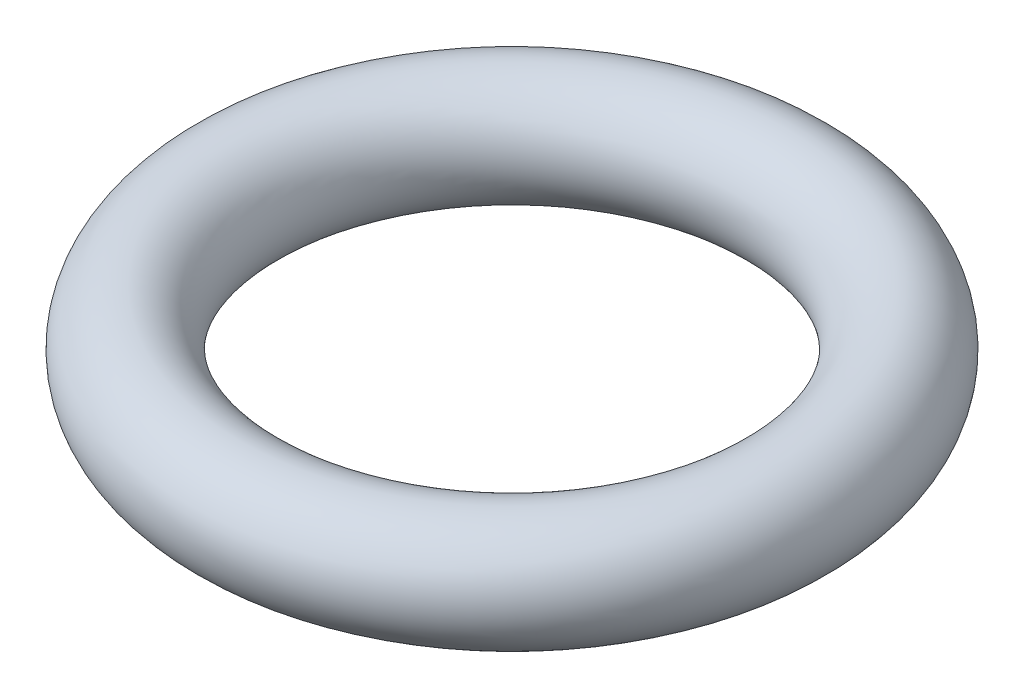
ISO-10303-21;
HEADER;
FILE_DESCRIPTION(('STEP AP214'),'2;1');
FILE_NAME('part.step','',(''),(''),'','','');
FILE_SCHEMA(('AUTOMOTIVE_DESIGN { 1 0 10303 214 1 1 1 1 }'));
ENDSEC;
DATA;
#1=APPLICATION_CONTEXT('core data for automotive mechanical design processes');
#2=APPLICATION_PROTOCOL_DEFINITION('international standard','automotive_design',2000,#1);
#3=PRODUCT_CONTEXT('',#1,'mechanical');
#4=PRODUCT('Part','Part','',(#3));
#5=PRODUCT_RELATED_PRODUCT_CATEGORY('part','',(#4));
#6=PRODUCT_DEFINITION_FORMATION('','',#4);
#7=PRODUCT_DEFINITION_CONTEXT('part definition',#1,'design');
#8=PRODUCT_DEFINITION('design','',#6,#7);
#9=PRODUCT_DEFINITION_SHAPE('','',#8);
#10=(LENGTH_UNIT() NAMED_UNIT(*) SI_UNIT(.MILLI.,.METRE.));
#11=(NAMED_UNIT(*) PLANE_ANGLE_UNIT() SI_UNIT($,.RADIAN.));
#12=(NAMED_UNIT(*) SI_UNIT($,.STERADIAN.) SOLID_ANGLE_UNIT());
#13=UNCERTAINTY_MEASURE_WITH_UNIT(LENGTH_MEASURE(1.E-05),#10,'distance_accuracy_value','');
#14=(GEOMETRIC_REPRESENTATION_CONTEXT(3) GLOBAL_UNCERTAINTY_ASSIGNED_CONTEXT((#13)) GLOBAL_UNIT_ASSIGNED_CONTEXT((#10,
#11,#12)) REPRESENTATION_CONTEXT('',''));
#15=CARTESIAN_POINT('',(0.,0.,0.));
#16=DIRECTION('',(0.,0.,1.));
#17=DIRECTION('',(1.,0.,0.));
#18=AXIS2_PLACEMENT_3D('',#15,#16,#17);
#19=CARTESIAN_POINT('',(0.,0.,0.));
#20=DIRECTION('',(0.,1.,0.));
#21=DIRECTION('',(0.,0.,1.));
#22=AXIS2_PLACEMENT_3D('',#19,#20,#21);
#23=TOROIDAL_SURFACE('',#22,4.15,0.85);
#24=CARTESIAN_POINT('',(0.,0.,5.));
#25=VERTEX_POINT('',#24);
#26=VERTEX_LOOP('',#25);
#27=FACE_BOUND('',#26,.T.);
#28=ADVANCED_FACE('F351',(#27),#23,.T.);
#29=CLOSED_SHELL('',(#28));
#30=MANIFOLD_SOLID_BREP('B2',#29);
#31=ADVANCED_BREP_SHAPE_REPRESENTATION('',(#18,#30),#14);
#32=SHAPE_DEFINITION_REPRESENTATION(#9,#31);
ENDSEC;
END-ISO-10303-21;
